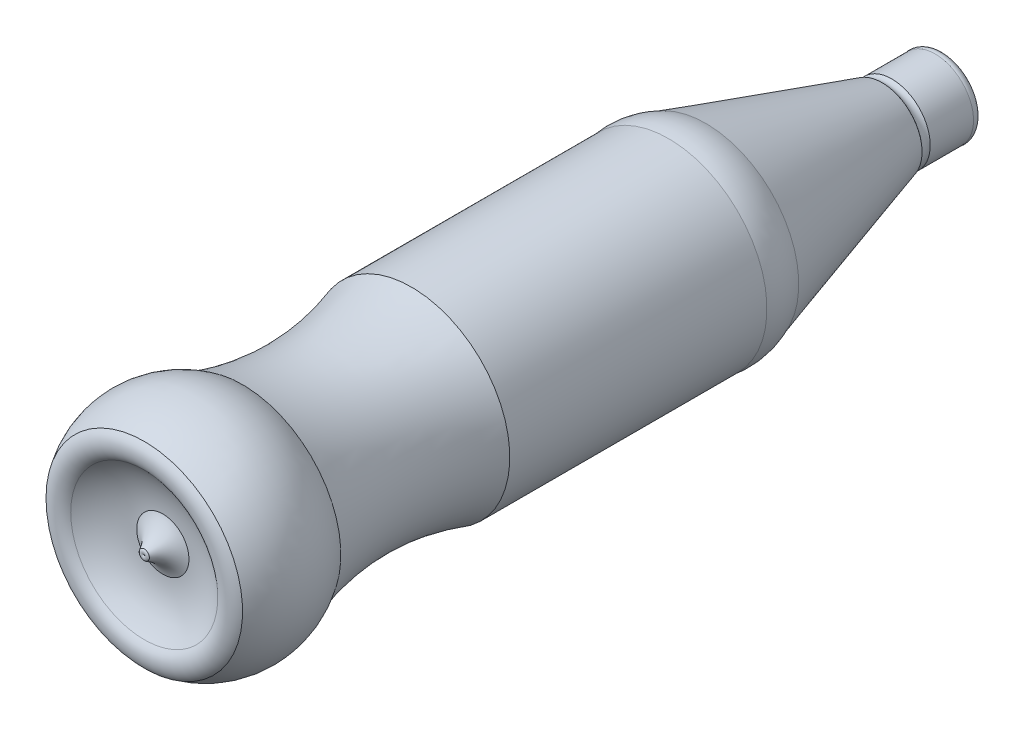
ISO-10303-21;
HEADER;
FILE_DESCRIPTION(('STEP AP214'),'2;1');
FILE_NAME('part.step','',(''),(''),'','','');
FILE_SCHEMA(('AUTOMOTIVE_DESIGN { 1 0 10303 214 1 1 1 1 }'));
ENDSEC;
DATA;
#1=APPLICATION_CONTEXT('core data for automotive mechanical design processes');
#2=APPLICATION_PROTOCOL_DEFINITION('international standard','automotive_design',2000,#1);
#3=PRODUCT_CONTEXT('',#1,'mechanical');
#4=PRODUCT('Part','Part','',(#3));
#5=PRODUCT_RELATED_PRODUCT_CATEGORY('part','',(#4));
#6=PRODUCT_DEFINITION_FORMATION('','',#4);
#7=PRODUCT_DEFINITION_CONTEXT('part definition',#1,'design');
#8=PRODUCT_DEFINITION('design','',#6,#7);
#9=PRODUCT_DEFINITION_SHAPE('','',#8);
#10=(LENGTH_UNIT() NAMED_UNIT(*) SI_UNIT(.MILLI.,.METRE.));
#11=(NAMED_UNIT(*) PLANE_ANGLE_UNIT() SI_UNIT($,.RADIAN.));
#12=(NAMED_UNIT(*) SI_UNIT($,.STERADIAN.) SOLID_ANGLE_UNIT());
#13=UNCERTAINTY_MEASURE_WITH_UNIT(LENGTH_MEASURE(1.E-05),#10,'distance_accuracy_value','');
#14=(GEOMETRIC_REPRESENTATION_CONTEXT(3) GLOBAL_UNCERTAINTY_ASSIGNED_CONTEXT((#13)) GLOBAL_UNIT_ASSIGNED_CONTEXT((#10,
#11,#12)) REPRESENTATION_CONTEXT('',''));
#15=CARTESIAN_POINT('',(0.,0.,0.));
#16=DIRECTION('',(0.,0.,1.));
#17=DIRECTION('',(1.,0.,0.));
#18=AXIS2_PLACEMENT_3D('',#15,#16,#17);
#19=CARTESIAN_POINT('',(0.,0.,-113.622047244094));
#20=DIRECTION('',(0.,0.,1.));
#21=DIRECTION('',(1.,0.,0.));
#22=AXIS2_PLACEMENT_3D('',#19,#20,#21);
#23=PLANE('',#22);
#24=CARTESIAN_POINT('',(0.,0.,-113.622047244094));
#25=DIRECTION('',(0.,0.,-1.));
#26=DIRECTION('',(-1.,0.,0.));
#27=AXIS2_PLACEMENT_3D('',#24,#25,#26);
#28=CIRCLE('',#27,11.1011155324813);
#29=CARTESIAN_POINT('',(-11.1011155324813,0.,-113.622047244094));
#30=VERTEX_POINT('',#29);
#31=EDGE_CURVE('E11',#30,#30,#28,.T.);
#32=ORIENTED_EDGE('',*,*,#31,.T.);
#33=EDGE_LOOP('',(#32));
#34=FACE_BOUND('',#33,.T.);
#35=ADVANCED_FACE('F35',(#34),#23,.F.);
#36=CARTESIAN_POINT('',(0.,0.,-111.666534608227));
#37=DIRECTION('',(0.,0.,-1.));
#38=DIRECTION('',(-1.,0.,0.));
#39=AXIS2_PLACEMENT_3D('',#36,#37,#38);
#40=TOROIDAL_SURFACE('',#39,10.5444873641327,2.03319074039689);
#41=ORIENTED_EDGE('',*,*,#31,.F.);
#42=EDGE_LOOP('',(#41));
#43=FACE_BOUND('',#42,.T.);
#44=CARTESIAN_POINT('',(0.,0.,-111.109906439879));
#45=DIRECTION('',(0.,0.,-1.));
#46=DIRECTION('',(-1.,0.,0.));
#47=AXIS2_PLACEMENT_3D('',#44,#45,#46);
#48=CIRCLE('',#47,12.5);
#49=CARTESIAN_POINT('',(-12.5,0.,-111.109906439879));
#50=VERTEX_POINT('',#49);
#51=EDGE_CURVE('E41',#50,#50,#48,.T.);
#52=ORIENTED_EDGE('',*,*,#51,.T.);
#53=EDGE_LOOP('',(#52));
#54=FACE_BOUND('',#53,.T.);
#55=ADVANCED_FACE('F57',(#43,#54),#40,.T.);
#56=CARTESIAN_POINT('',(0.,0.,-113.622047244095));
#57=DIRECTION('',(0.,0.,-1.));
#58=DIRECTION('',(-1.,0.,0.));
#59=AXIS2_PLACEMENT_3D('',#56,#57,#58);
#60=CYLINDRICAL_SURFACE('',#59,12.5);
#61=ORIENTED_EDGE('',*,*,#51,.F.);
#62=EDGE_LOOP('',(#61));
#63=FACE_BOUND('',#62,.T.);
#64=CARTESIAN_POINT('',(0.,0.,-97.0044992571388));
#65=DIRECTION('',(0.,0.,-1.));
#66=DIRECTION('',(-1.,0.,0.));
#67=AXIS2_PLACEMENT_3D('',#64,#65,#66);
#68=CIRCLE('',#67,12.5);
#69=CARTESIAN_POINT('',(-12.5,0.,-97.0044992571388));
#70=VERTEX_POINT('',#69);
#71=EDGE_CURVE('E69',#70,#70,#68,.T.);
#72=ORIENTED_EDGE('',*,*,#71,.T.);
#73=EDGE_LOOP('',(#72));
#74=FACE_BOUND('',#73,.T.);
#75=ADVANCED_FACE('F62',(#63,#74),#60,.T.);
#76=CARTESIAN_POINT('',(0.,0.,-95.6783369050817));
#77=DIRECTION('',(0.,0.,-1.));
#78=DIRECTION('',(-1.,0.,0.));
#79=AXIS2_PLACEMENT_3D('',#76,#77,#78);
#80=TOROIDAL_SURFACE('',#79,14.3703935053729,2.29283197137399);
#81=ORIENTED_EDGE('',*,*,#71,.F.);
#82=EDGE_LOOP('',(#81));
#83=FACE_BOUND('',#82,.T.);
#84=CARTESIAN_POINT('',(0.,0.,-93.8079433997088));
#85=DIRECTION('',(0.,0.,-1.));
#86=DIRECTION('',(-1.,0.,0.));
#87=AXIS2_PLACEMENT_3D('',#84,#85,#86);
#88=CIRCLE('',#87,13.0442311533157);
#89=CARTESIAN_POINT('',(-13.0442311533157,0.,-93.8079433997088));
#90=VERTEX_POINT('',#89);
#91=EDGE_CURVE('E71',#90,#90,#88,.T.);
#92=ORIENTED_EDGE('',*,*,#91,.T.);
#93=EDGE_LOOP('',(#92));
#94=FACE_BOUND('',#93,.T.);
#95=ADVANCED_FACE('F132',(#83,#94),#80,.F.);
#96=CARTESIAN_POINT('',(0.,0.,-36.4526572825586));
#97=DIRECTION('',(0.,0.,1.));
#98=DIRECTION('',(1.,0.,0.));
#99=AXIS2_PLACEMENT_3D('',#96,#97,#98);
#100=CONICAL_SURFACE('',#99,30.2508169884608,0.291456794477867);
#101=ORIENTED_EDGE('',*,*,#91,.F.);
#102=EDGE_LOOP('',(#101));
#103=FACE_BOUND('',#102,.T.);
#104=CARTESIAN_POINT('',(0.,0.,-36.4526572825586));
#105=DIRECTION('',(0.,0.,-1.));
#106=DIRECTION('',(-1.,0.,0.));
#107=AXIS2_PLACEMENT_3D('',#104,#105,#106);
#108=CIRCLE('',#107,30.2508169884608);
#109=CARTESIAN_POINT('',(-30.2508169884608,0.,-36.4526572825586));
#110=VERTEX_POINT('',#109);
#111=EDGE_CURVE('E76',#110,#110,#108,.T.);
#112=ORIENTED_EDGE('',*,*,#111,.T.);
#113=EDGE_LOOP('',(#112));
#114=FACE_BOUND('',#113,.T.);
#115=ADVANCED_FACE('F128',(#103,#114),#100,.T.);
#116=CARTESIAN_POINT('',(0.,0.,-27.5045890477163));
#117=DIRECTION('',(0.,0.,-1.));
#118=DIRECTION('',(-1.,0.,0.));
#119=AXIS2_PLACEMENT_3D('',#116,#117,#118);
#120=DEGENERATE_TOROIDAL_SURFACE('',#119,11.1011155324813,21.1371471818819,.T.);
#121=ORIENTED_EDGE('',*,*,#111,.F.);
#122=EDGE_LOOP('',(#121));
#123=FACE_BOUND('',#122,.T.);
#124=CARTESIAN_POINT('',(0.,0.,-24.3398427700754));
#125=DIRECTION('',(0.,0.,-1.));
#126=DIRECTION('',(-1.,0.,0.));
#127=AXIS2_PLACEMENT_3D('',#124,#125,#126);
#128=CIRCLE('',#127,32.);
#129=CARTESIAN_POINT('',(-32.,0.,-24.3398427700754));
#130=VERTEX_POINT('',#129);
#131=EDGE_CURVE('E79',#130,#130,#128,.T.);
#132=ORIENTED_EDGE('',*,*,#131,.T.);
#133=EDGE_LOOP('',(#132));
#134=FACE_BOUND('',#133,.T.);
#135=ADVANCED_FACE('F124',(#123,#134),#120,.T.);
#136=CARTESIAN_POINT('',(0.,0.,-113.622047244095));
#137=DIRECTION('',(0.,0.,-1.));
#138=DIRECTION('',(-1.,0.,0.));
#139=AXIS2_PLACEMENT_3D('',#136,#137,#138);
#140=CYLINDRICAL_SURFACE('',#139,32.);
#141=ORIENTED_EDGE('',*,*,#131,.F.);
#142=EDGE_LOOP('',(#141));
#143=FACE_BOUND('',#142,.T.);
#144=CARTESIAN_POINT('',(0.,0.,59.3779527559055));
#145=DIRECTION('',(0.,0.,-1.));
#146=DIRECTION('',(-1.,0.,0.));
#147=AXIS2_PLACEMENT_3D('',#144,#145,#146);
#148=CIRCLE('',#147,32.);
#149=CARTESIAN_POINT('',(-32.,0.,59.3779527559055));
#150=VERTEX_POINT('',#149);
#151=EDGE_CURVE('E82',#150,#150,#148,.T.);
#152=ORIENTED_EDGE('',*,*,#151,.T.);
#153=EDGE_LOOP('',(#152));
#154=FACE_BOUND('',#153,.T.);
#155=ADVANCED_FACE('F120',(#143,#154),#140,.T.);
#156=CARTESIAN_POINT('',(0.,0.,86.8779527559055));
#157=DIRECTION('',(0.,0.,-1.));
#158=DIRECTION('',(-1.,0.,0.));
#159=AXIS2_PLACEMENT_3D('',#156,#157,#158);
#160=TOROIDAL_SURFACE('',#159,118.337331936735,90.61117417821);
#161=ORIENTED_EDGE('',*,*,#151,.F.);
#162=EDGE_LOOP('',(#161));
#163=FACE_BOUND('',#162,.T.);
#164=CARTESIAN_POINT('',(0.,0.,114.377952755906));
#165=DIRECTION('',(0.,0.,-1.));
#166=DIRECTION('',(-1.,0.,0.));
#167=AXIS2_PLACEMENT_3D('',#164,#165,#166);
#168=CIRCLE('',#167,32.);
#169=CARTESIAN_POINT('',(-32.,0.,114.377952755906));
#170=VERTEX_POINT('',#169);
#171=EDGE_CURVE('E85',#170,#170,#168,.T.);
#172=ORIENTED_EDGE('',*,*,#171,.T.);
#173=EDGE_LOOP('',(#172));
#174=FACE_BOUND('',#173,.T.);
#175=ADVANCED_FACE('F116',(#163,#174),#160,.F.);
#176=CARTESIAN_POINT('',(0.,0.,130.377952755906));
#177=DIRECTION('',(0.,0.,-1.));
#178=DIRECTION('',(-1.,0.,0.));
#179=AXIS2_PLACEMENT_3D('',#176,#177,#178);
#180=DEGENERATE_TOROIDAL_SURFACE('',#179,8.4970560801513,28.4321714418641,.T.);
#181=ORIENTED_EDGE('',*,*,#171,.F.);
#182=EDGE_LOOP('',(#181));
#183=FACE_BOUND('',#182,.T.);
#184=CARTESIAN_POINT('',(0.,0.,146.377952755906));
#185=DIRECTION('',(0.,0.,-1.));
#186=DIRECTION('',(-1.,0.,0.));
#187=AXIS2_PLACEMENT_3D('',#184,#185,#186);
#188=CIRCLE('',#187,32.);
#189=CARTESIAN_POINT('',(-32.,0.,146.377952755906));
#190=VERTEX_POINT('',#189);
#191=EDGE_CURVE('E88',#190,#190,#188,.T.);
#192=ORIENTED_EDGE('',*,*,#191,.T.);
#193=EDGE_LOOP('',(#192));
#194=FACE_BOUND('',#193,.T.);
#195=ADVANCED_FACE('F109',(#183,#194),#180,.T.);
#196=CARTESIAN_POINT('',(0.,0.,142.35009994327));
#197=DIRECTION('',(0.,0.,-1.));
#198=DIRECTION('',(-1.,0.,0.));
#199=AXIS2_PLACEMENT_3D('',#196,#197,#198);
#200=TOROIDAL_SURFACE('',#199,27.9721471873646,5.69624407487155);
#201=ORIENTED_EDGE('',*,*,#191,.F.);
#202=EDGE_LOOP('',(#201));
#203=FACE_BOUND('',#202,.T.);
#204=CARTESIAN_POINT('',(0.,0.,146.377952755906));
#205=DIRECTION('',(0.,0.,-1.));
#206=DIRECTION('',(-1.,0.,0.));
#207=AXIS2_PLACEMENT_3D('',#204,#205,#206);
#208=CIRCLE('',#207,23.9442943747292);
#209=CARTESIAN_POINT('',(-23.9442943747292,0.,146.377952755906));
#210=VERTEX_POINT('',#209);
#211=EDGE_CURVE('E91',#210,#210,#208,.T.);
#212=ORIENTED_EDGE('',*,*,#211,.T.);
#213=EDGE_LOOP('',(#212));
#214=FACE_BOUND('',#213,.T.);
#215=ADVANCED_FACE('F103',(#203,#214),#200,.T.);
#216=CARTESIAN_POINT('',(0.,0.,164.084409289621));
#217=DIRECTION('',(0.,0.,-1.));
#218=DIRECTION('',(-1.,0.,0.));
#219=AXIS2_PLACEMENT_3D('',#216,#217,#218);
#220=DEGENERATE_TOROIDAL_SURFACE('',#219,8.11362199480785,23.7513955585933,.T.);
#221=ORIENTED_EDGE('',*,*,#211,.F.);
#222=EDGE_LOOP('',(#221));
#223=FACE_BOUND('',#222,.T.);
#224=CARTESIAN_POINT('',(0.,0.,140.336108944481));
#225=DIRECTION('',(0.,0.,-1.));
#226=DIRECTION('',(-1.,0.,0.));
#227=AXIS2_PLACEMENT_3D('',#224,#225,#226);
#228=CIRCLE('',#227,8.4970560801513);
#229=CARTESIAN_POINT('',(-8.4970560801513,0.,140.336108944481));
#230=VERTEX_POINT('',#229);
#231=EDGE_CURVE('E94',#230,#230,#228,.T.);
#232=ORIENTED_EDGE('',*,*,#231,.T.);
#233=EDGE_LOOP('',(#232));
#234=FACE_BOUND('',#233,.T.);
#235=ADVANCED_FACE('F52',(#223,#234),#220,.F.);
#236=CARTESIAN_POINT('',(0.,0.,151.918243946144));
#237=DIRECTION('',(0.,0.,-1.));
#238=DIRECTION('',(-1.,0.,0.));
#239=AXIS2_PLACEMENT_3D('',#236,#237,#238);
#240=TOROIDAL_SURFACE('',#239,12.6451904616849,12.3025554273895);
#241=ORIENTED_EDGE('',*,*,#231,.F.);
#242=EDGE_LOOP('',(#241));
#243=FACE_BOUND('',#242,.T.);
#244=CARTESIAN_POINT('',(0.,0.,146.377952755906));
#245=DIRECTION('',(0.,0.,-1.));
#246=DIRECTION('',(-1.,0.,0.));
#247=AXIS2_PLACEMENT_3D('',#244,#245,#246);
#248=CIRCLE('',#247,1.66074493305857);
#249=CARTESIAN_POINT('',(-1.66074493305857,0.,146.377952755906));
#250=VERTEX_POINT('',#249);
#251=EDGE_CURVE('E97',#250,#250,#248,.T.);
#252=ORIENTED_EDGE('',*,*,#251,.T.);
#253=EDGE_LOOP('',(#252));
#254=FACE_BOUND('',#253,.T.);
#255=ADVANCED_FACE('F46',(#243,#254),#240,.F.);
#256=CARTESIAN_POINT('',(-0.830372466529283,0.,145.547580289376));
#257=DIRECTION('',(0.,-1.,0.));
#258=DIRECTION('',(-1.,0.,0.));
#259=AXIS2_PLACEMENT_3D('',#256,#257,#258);
#260=CIRCLE('',#259,1.17432400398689);
#261=TRIMMED_CURVE('',#260,(PARAMETER_VALUE(-2.35619449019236)),
(PARAMETER_VALUE(2.35619449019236)),.T.,.PARAMETER.);
#262=CARTESIAN_POINT('',(0.,0.,145.547580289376));
#263=DIRECTION('',(0.,0.,-1.));
#264=AXIS1_PLACEMENT('',#262,#263);
#265=SURFACE_OF_REVOLUTION('',#261,#264);
#266=ORIENTED_EDGE('',*,*,#251,.F.);
#267=EDGE_LOOP('',(#266));
#268=FACE_BOUND('',#267,.T.);
#269=CARTESIAN_POINT('',(0.,0.,146.377952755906));
#270=VERTEX_POINT('',#269);
#271=VERTEX_LOOP('',#270);
#272=FACE_BOUND('',#271,.T.);
#273=ADVANCED_FACE('F44',(#268,#272),#265,.T.);
#274=CLOSED_SHELL('',(#35,#55,#75,#95,#115,#135,#155,#175,#195,#215,#235,#255,#273));
#275=MANIFOLD_SOLID_BREP('B2',#274);
#276=ADVANCED_BREP_SHAPE_REPRESENTATION('',(#18,#275),#14);
#277=SHAPE_DEFINITION_REPRESENTATION(#9,#276);
ENDSEC;
END-ISO-10303-21;
